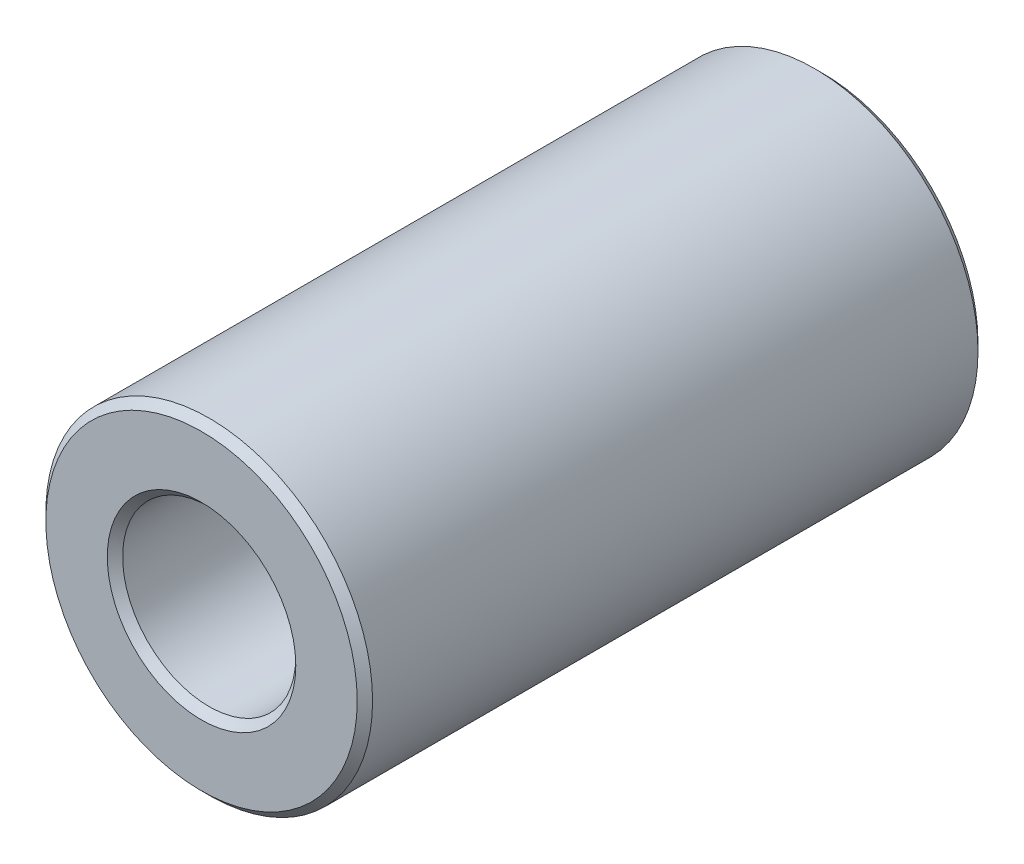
ISO-10303-21;
HEADER;
FILE_DESCRIPTION(('STEP AP214'),'2;1');
FILE_NAME('part.step','',(''),(''),'','','');
FILE_SCHEMA(('AUTOMOTIVE_DESIGN { 1 0 10303 214 1 1 1 1 }'));
ENDSEC;
DATA;
#1=APPLICATION_CONTEXT('core data for automotive mechanical design processes');
#2=APPLICATION_PROTOCOL_DEFINITION('international standard','automotive_design',2000,#1);
#3=PRODUCT_CONTEXT('',#1,'mechanical');
#4=PRODUCT('Part','Part','',(#3));
#5=PRODUCT_RELATED_PRODUCT_CATEGORY('part','',(#4));
#6=PRODUCT_DEFINITION_FORMATION('','',#4);
#7=PRODUCT_DEFINITION_CONTEXT('part definition',#1,'design');
#8=PRODUCT_DEFINITION('design','',#6,#7);
#9=PRODUCT_DEFINITION_SHAPE('','',#8);
#10=(LENGTH_UNIT() NAMED_UNIT(*) SI_UNIT(.MILLI.,.METRE.));
#11=(NAMED_UNIT(*) PLANE_ANGLE_UNIT() SI_UNIT($,.RADIAN.));
#12=(NAMED_UNIT(*) SI_UNIT($,.STERADIAN.) SOLID_ANGLE_UNIT());
#13=UNCERTAINTY_MEASURE_WITH_UNIT(LENGTH_MEASURE(1.E-05),#10,'distance_accuracy_value','');
#14=(GEOMETRIC_REPRESENTATION_CONTEXT(3) GLOBAL_UNCERTAINTY_ASSIGNED_CONTEXT((#13)) GLOBAL_UNIT_ASSIGNED_CONTEXT((#10,
#11,#12)) REPRESENTATION_CONTEXT('',''));
#15=CARTESIAN_POINT('',(0.,0.,0.));
#16=DIRECTION('',(0.,0.,1.));
#17=DIRECTION('',(1.,0.,0.));
#18=AXIS2_PLACEMENT_3D('',#15,#16,#17);
#19=CARTESIAN_POINT('',(0.,0.,-9.5));
#20=DIRECTION('',(0.,0.,1.));
#21=DIRECTION('',(1.,0.,0.));
#22=AXIS2_PLACEMENT_3D('',#19,#20,#21);
#23=CYLINDRICAL_SURFACE('',#22,5.);
#24=CARTESIAN_POINT('',(0.,0.,9.265));
#25=DIRECTION('',(0.,0.,1.));
#26=DIRECTION('',(1.,0.,0.));
#27=AXIS2_PLACEMENT_3D('',#24,#25,#26);
#28=CIRCLE('',#27,5.);
#29=CARTESIAN_POINT('',(5.,0.,9.265));
#30=VERTEX_POINT('',#29);
#31=EDGE_CURVE('E50',#30,#30,#28,.F.);
#32=ORIENTED_EDGE('',*,*,#31,.T.);
#33=EDGE_LOOP('',(#32));
#34=FACE_BOUND('',#33,.T.);
#35=CARTESIAN_POINT('',(0.,0.,-9.265));
#36=DIRECTION('',(0.,0.,1.));
#37=DIRECTION('',(1.,0.,0.));
#38=AXIS2_PLACEMENT_3D('',#35,#36,#37);
#39=CIRCLE('',#38,5.);
#40=CARTESIAN_POINT('',(5.,0.,-9.265));
#41=VERTEX_POINT('',#40);
#42=EDGE_CURVE('E53',#41,#41,#39,.T.);
#43=ORIENTED_EDGE('',*,*,#42,.T.);
#44=EDGE_LOOP('',(#43));
#45=FACE_BOUND('',#44,.T.);
#46=ADVANCED_FACE('F30',(#34,#45),#23,.T.);
#47=CARTESIAN_POINT('',(0.,0.,-9.5));
#48=DIRECTION('',(0.,0.,1.));
#49=DIRECTION('',(1.,0.,0.));
#50=AXIS2_PLACEMENT_3D('',#47,#48,#49);
#51=PLANE('',#50);
#52=CARTESIAN_POINT('',(0.,0.,-9.5));
#53=DIRECTION('',(0.,0.,1.));
#54=DIRECTION('',(1.,0.,0.));
#55=AXIS2_PLACEMENT_3D('',#52,#53,#54);
#56=CIRCLE('',#55,4.765);
#57=CARTESIAN_POINT('',(4.765,0.,-9.5));
#58=VERTEX_POINT('',#57);
#59=EDGE_CURVE('E41',#58,#58,#56,.F.);
#60=ORIENTED_EDGE('',*,*,#59,.T.);
#61=EDGE_LOOP('',(#60));
#62=FACE_BOUND('',#61,.T.);
#63=CARTESIAN_POINT('',(0.,0.,-9.5));
#64=DIRECTION('',(0.,0.,1.));
#65=DIRECTION('',(1.,0.,0.));
#66=AXIS2_PLACEMENT_3D('',#63,#64,#65);
#67=CIRCLE('',#66,2.885);
#68=CARTESIAN_POINT('',(2.885,0.,-9.5));
#69=VERTEX_POINT('',#68);
#70=EDGE_CURVE('E45',#69,#69,#67,.T.);
#71=ORIENTED_EDGE('',*,*,#70,.T.);
#72=EDGE_LOOP('',(#71));
#73=FACE_BOUND('',#72,.T.);
#74=ADVANCED_FACE('F78',(#62,#73),#51,.F.);
#75=CARTESIAN_POINT('',(0.,0.,-9.5));
#76=DIRECTION('',(0.,0.,1.));
#77=DIRECTION('',(1.,0.,0.));
#78=AXIS2_PLACEMENT_3D('',#75,#76,#77);
#79=CYLINDRICAL_SURFACE('',#78,2.65);
#80=CARTESIAN_POINT('',(0.,0.,9.265));
#81=DIRECTION('',(0.,0.,1.));
#82=DIRECTION('',(1.,0.,0.));
#83=AXIS2_PLACEMENT_3D('',#80,#81,#82);
#84=CIRCLE('',#83,2.65);
#85=CARTESIAN_POINT('',(2.65,0.,9.265));
#86=VERTEX_POINT('',#85);
#87=EDGE_CURVE('E10',#86,#86,#84,.T.);
#88=CARTESIAN_POINT('',(0.,0.,-9.265));
#89=DIRECTION('',(0.,0.,1.));
#90=DIRECTION('',(1.,0.,0.));
#91=AXIS2_PLACEMENT_3D('',#88,#89,#90);
#92=CIRCLE('',#91,2.65);
#93=CARTESIAN_POINT('',(2.65,0.,-9.265));
#94=VERTEX_POINT('',#93);
#95=EDGE_CURVE('E37',#94,#94,#92,.F.);
#96=CARTESIAN_POINT('',(2.65,0.,9.265));
#97=CARTESIAN_POINT('',(2.65,0.,9.07197916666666));
#98=CARTESIAN_POINT('',(2.65,0.,8.87895833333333));
#99=CARTESIAN_POINT('',(2.65,0.,8.49291666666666));
#100=CARTESIAN_POINT('',(2.65,0.,8.29989583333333));
#101=CARTESIAN_POINT('',(2.65,0.,7.91385416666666));
#102=CARTESIAN_POINT('',(2.65,0.,7.72083333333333));
#103=CARTESIAN_POINT('',(2.65,0.,7.33479166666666));
#104=CARTESIAN_POINT('',(2.65,0.,7.14177083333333));
#105=CARTESIAN_POINT('',(2.65,0.,6.75572916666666));
#106=CARTESIAN_POINT('',(2.65,0.,6.56270833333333));
#107=CARTESIAN_POINT('',(2.65,0.,6.17666666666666));
#108=CARTESIAN_POINT('',(2.65,0.,5.98364583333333));
#109=CARTESIAN_POINT('',(2.65,0.,5.59760416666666));
#110=CARTESIAN_POINT('',(2.65,0.,5.40458333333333));
#111=CARTESIAN_POINT('',(2.65,0.,5.01854166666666));
#112=CARTESIAN_POINT('',(2.65,0.,4.82552083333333));
#113=CARTESIAN_POINT('',(2.65,0.,4.43947916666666));
#114=CARTESIAN_POINT('',(2.65,0.,4.24645833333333));
#115=CARTESIAN_POINT('',(2.65,0.,3.86041666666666));
#116=CARTESIAN_POINT('',(2.65,0.,3.66739583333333));
#117=CARTESIAN_POINT('',(2.65,0.,3.28135416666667));
#118=CARTESIAN_POINT('',(2.65,0.,3.08833333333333));
#119=CARTESIAN_POINT('',(2.65,0.,2.70229166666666));
#120=CARTESIAN_POINT('',(2.65,0.,2.50927083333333));
#121=CARTESIAN_POINT('',(2.65,0.,2.12322916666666));
#122=CARTESIAN_POINT('',(2.65,0.,1.93020833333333));
#123=CARTESIAN_POINT('',(2.65,0.,1.54416666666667));
#124=CARTESIAN_POINT('',(2.65,0.,1.35114583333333));
#125=CARTESIAN_POINT('',(2.65,0.,0.965104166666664));
#126=CARTESIAN_POINT('',(2.65,0.,0.772083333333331));
#127=CARTESIAN_POINT('',(2.65,0.,0.386041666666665));
#128=CARTESIAN_POINT('',(2.65,0.,0.193020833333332));
#129=CARTESIAN_POINT('',(2.65,0.,-0.193020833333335));
#130=CARTESIAN_POINT('',(2.65,0.,-0.386041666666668));
#131=CARTESIAN_POINT('',(2.65,0.,-0.772083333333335));
#132=CARTESIAN_POINT('',(2.65,0.,-0.965104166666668));
#133=CARTESIAN_POINT('',(2.65,0.,-1.35114583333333));
#134=CARTESIAN_POINT('',(2.65,0.,-1.54416666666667));
#135=CARTESIAN_POINT('',(2.65,0.,-1.93020833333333));
#136=CARTESIAN_POINT('',(2.65,0.,-2.12322916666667));
#137=CARTESIAN_POINT('',(2.65,0.,-2.50927083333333));
#138=CARTESIAN_POINT('',(2.65,0.,-2.70229166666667));
#139=CARTESIAN_POINT('',(2.65,0.,-3.08833333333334));
#140=CARTESIAN_POINT('',(2.65,0.,-3.28135416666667));
#141=CARTESIAN_POINT('',(2.65,0.,-3.66739583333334));
#142=CARTESIAN_POINT('',(2.65,0.,-3.86041666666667));
#143=CARTESIAN_POINT('',(2.65,0.,-4.24645833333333));
#144=CARTESIAN_POINT('',(2.65,0.,-4.43947916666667));
#145=CARTESIAN_POINT('',(2.65,0.,-4.82552083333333));
#146=CARTESIAN_POINT('',(2.65,0.,-5.01854166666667));
#147=CARTESIAN_POINT('',(2.65,0.,-5.40458333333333));
#148=CARTESIAN_POINT('',(2.65,0.,-5.59760416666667));
#149=CARTESIAN_POINT('',(2.65,0.,-5.98364583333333));
#150=CARTESIAN_POINT('',(2.65,0.,-6.17666666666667));
#151=CARTESIAN_POINT('',(2.65,0.,-6.56270833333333));
#152=CARTESIAN_POINT('',(2.65,0.,-6.75572916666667));
#153=CARTESIAN_POINT('',(2.65,0.,-7.14177083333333));
#154=CARTESIAN_POINT('',(2.65,0.,-7.33479166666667));
#155=CARTESIAN_POINT('',(2.65,0.,-7.72083333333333));
#156=CARTESIAN_POINT('',(2.65,0.,-7.91385416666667));
#157=CARTESIAN_POINT('',(2.65,0.,-8.29989583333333));
#158=CARTESIAN_POINT('',(2.65,0.,-8.49291666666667));
#159=CARTESIAN_POINT('',(2.65,0.,-8.87895833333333));
#160=CARTESIAN_POINT('',(2.65,0.,-9.07197916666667));
#161=CARTESIAN_POINT('',(2.65,0.,-9.265));
#162=B_SPLINE_CURVE_WITH_KNOTS('',3,(#96,#97,#98,#99,#100,#101,#102,#103,#104,#105,#106,#107,
#108,#109,#110,#111,#112,#113,#114,#115,#116,#117,#118,#119,#120,#121,#122,#123,#124,#125,#126,
#127,#128,#129,#130,#131,#132,#133,#134,#135,#136,#137,#138,#139,#140,#141,#142,#143,#144,#145,
#146,#147,#148,#149,#150,#151,#152,#153,#154,#155,#156,#157,#158,#159,#160,#161),.UNSPECIFIED.,
.F.,.F.,(4,2,2,2,2,2,2,2,2,2,2,2,2,2,2,2,2,2,2,2,2,2,2,2,2,2,2,2,2,2,2,2,4),(0.,
0.579062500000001,1.158125,1.7371875,2.31625,2.8953125,3.474375,4.0534375,4.6325,5.2115625,
5.790625,6.3696875,6.94875,7.5278125,8.106875,8.6859375,9.265,9.8440625,10.423125,11.0021875,
11.58125,12.1603125,12.739375,13.3184375,13.8975,14.4765625,15.055625,15.6346875,16.21375,
16.7928125,17.371875,17.9509375,18.53),.UNSPECIFIED.);
#163=EDGE_CURVE('BSEAM84',#86,#94,#162,.T.);
#164=ORIENTED_EDGE('',*,*,#87,.T.);
#165=ORIENTED_EDGE('',*,*,#95,.T.);
#166=ORIENTED_EDGE('',*,*,#163,.T.);
#167=ORIENTED_EDGE('',*,*,#163,.F.);
#168=EDGE_LOOP('',(#164,#166,#165,#167));
#169=FACE_BOUND('',#168,.T.);
#170=ADVANCED_FACE('F84',(#169),#79,.F.);
#171=CARTESIAN_POINT('',(0.,0.,9.5));
#172=DIRECTION('',(0.,0.,1.));
#173=DIRECTION('',(1.,0.,0.));
#174=AXIS2_PLACEMENT_3D('',#171,#172,#173);
#175=PLANE('',#174);
#176=CARTESIAN_POINT('',(0.,0.,9.5));
#177=DIRECTION('',(0.,0.,1.));
#178=DIRECTION('',(1.,0.,0.));
#179=AXIS2_PLACEMENT_3D('',#176,#177,#178);
#180=CIRCLE('',#179,4.76500000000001);
#181=CARTESIAN_POINT('',(4.76500000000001,0.,9.5));
#182=VERTEX_POINT('',#181);
#183=EDGE_CURVE('E56',#182,#182,#180,.T.);
#184=ORIENTED_EDGE('',*,*,#183,.T.);
#185=EDGE_LOOP('',(#184));
#186=FACE_BOUND('',#185,.T.);
#187=CARTESIAN_POINT('',(0.,0.,9.5));
#188=DIRECTION('',(0.,0.,1.));
#189=DIRECTION('',(1.,0.,0.));
#190=AXIS2_PLACEMENT_3D('',#187,#188,#189);
#191=CIRCLE('',#190,2.88500000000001);
#192=CARTESIAN_POINT('',(2.885,0.,9.5));
#193=VERTEX_POINT('',#192);
#194=EDGE_CURVE('E59',#193,#193,#191,.F.);
#195=ORIENTED_EDGE('',*,*,#194,.T.);
#196=EDGE_LOOP('',(#195));
#197=FACE_BOUND('',#196,.T.);
#198=ADVANCED_FACE('F63',(#186,#197),#175,.T.);
#199=CARTESIAN_POINT('',(0.,0.,9.5));
#200=DIRECTION('',(0.,0.,-1.));
#201=DIRECTION('',(-1.,0.,0.));
#202=AXIS2_PLACEMENT_3D('',#199,#200,#201);
#203=CONICAL_SURFACE('',#202,4.76500000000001,0.785398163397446);
#204=ORIENTED_EDGE('',*,*,#31,.F.);
#205=EDGE_LOOP('',(#204));
#206=FACE_BOUND('',#205,.T.);
#207=ORIENTED_EDGE('',*,*,#183,.F.);
#208=EDGE_LOOP('',(#207));
#209=FACE_BOUND('',#208,.T.);
#210=ADVANCED_FACE('F74',(#206,#209),#203,.T.);
#211=CARTESIAN_POINT('',(0.,0.,-9.265));
#212=DIRECTION('',(0.,0.,1.));
#213=DIRECTION('',(1.,0.,0.));
#214=AXIS2_PLACEMENT_3D('',#211,#212,#213);
#215=CONICAL_SURFACE('',#214,5.,0.78539816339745);
#216=CARTESIAN_POINT('',(4.765,0.,-9.5));
#217=CARTESIAN_POINT('',(4.76744791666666,0.,-9.49755208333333));
#218=CARTESIAN_POINT('',(4.76989583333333,0.,-9.49510416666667));
#219=CARTESIAN_POINT('',(4.77479166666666,0.,-9.49020833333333));
#220=CARTESIAN_POINT('',(4.77723958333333,0.,-9.48776041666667));
#221=CARTESIAN_POINT('',(4.78213541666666,0.,-9.48286458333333));
#222=CARTESIAN_POINT('',(4.78458333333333,0.,-9.48041666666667));
#223=CARTESIAN_POINT('',(4.78947916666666,0.,-9.47552083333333));
#224=CARTESIAN_POINT('',(4.79192708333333,0.,-9.47307291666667));
#225=CARTESIAN_POINT('',(4.79682291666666,0.,-9.46817708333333));
#226=CARTESIAN_POINT('',(4.79927083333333,0.,-9.46572916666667));
#227=CARTESIAN_POINT('',(4.80416666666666,0.,-9.46083333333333));
#228=CARTESIAN_POINT('',(4.80661458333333,0.,-9.45838541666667));
#229=CARTESIAN_POINT('',(4.81151041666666,0.,-9.45348958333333));
#230=CARTESIAN_POINT('',(4.81395833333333,0.,-9.45104166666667));
#231=CARTESIAN_POINT('',(4.81885416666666,0.,-9.44614583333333));
#232=CARTESIAN_POINT('',(4.82130208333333,0.,-9.44369791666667));
#233=CARTESIAN_POINT('',(4.82619791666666,0.,-9.43880208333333));
#234=CARTESIAN_POINT('',(4.82864583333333,0.,-9.43635416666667));
#235=CARTESIAN_POINT('',(4.83354166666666,0.,-9.43145833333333));
#236=CARTESIAN_POINT('',(4.83598958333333,0.,-9.42901041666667));
#237=CARTESIAN_POINT('',(4.84088541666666,0.,-9.42411458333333));
#238=CARTESIAN_POINT('',(4.84333333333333,0.,-9.42166666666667));
#239=CARTESIAN_POINT('',(4.84822916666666,0.,-9.41677083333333));
#240=CARTESIAN_POINT('',(4.85067708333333,0.,-9.41432291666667));
#241=CARTESIAN_POINT('',(4.85557291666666,0.,-9.40942708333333));
#242=CARTESIAN_POINT('',(4.85802083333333,0.,-9.40697916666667));
#243=CARTESIAN_POINT('',(4.86291666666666,0.,-9.40208333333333));
#244=CARTESIAN_POINT('',(4.86536458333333,0.,-9.39963541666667));
#245=CARTESIAN_POINT('',(4.87026041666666,0.,-9.39473958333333));
#246=CARTESIAN_POINT('',(4.87270833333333,0.,-9.39229166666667));
#247=CARTESIAN_POINT('',(4.87760416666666,0.,-9.38739583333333));
#248=CARTESIAN_POINT('',(4.88005208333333,0.,-9.38494791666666));
#249=CARTESIAN_POINT('',(4.88494791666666,0.,-9.38005208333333));
#250=CARTESIAN_POINT('',(4.88739583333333,0.,-9.37760416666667));
#251=CARTESIAN_POINT('',(4.89229166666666,0.,-9.37270833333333));
#252=CARTESIAN_POINT('',(4.89473958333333,0.,-9.37026041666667));
#253=CARTESIAN_POINT('',(4.89963541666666,0.,-9.36536458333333));
#254=CARTESIAN_POINT('',(4.90208333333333,0.,-9.36291666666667));
#255=CARTESIAN_POINT('',(4.90697916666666,0.,-9.35802083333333));
#256=CARTESIAN_POINT('',(4.90942708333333,0.,-9.35557291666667));
#257=CARTESIAN_POINT('',(4.91432291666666,0.,-9.35067708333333));
#258=CARTESIAN_POINT('',(4.91677083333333,0.,-9.34822916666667));
#259=CARTESIAN_POINT('',(4.92166666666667,0.,-9.34333333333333));
#260=CARTESIAN_POINT('',(4.92411458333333,0.,-9.34088541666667));
#261=CARTESIAN_POINT('',(4.92901041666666,0.,-9.33598958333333));
#262=CARTESIAN_POINT('',(4.93145833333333,0.,-9.33354166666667));
#263=CARTESIAN_POINT('',(4.93635416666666,0.,-9.32864583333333));
#264=CARTESIAN_POINT('',(4.93880208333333,0.,-9.32619791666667));
#265=CARTESIAN_POINT('',(4.94369791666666,0.,-9.32130208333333));
#266=CARTESIAN_POINT('',(4.94614583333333,0.,-9.31885416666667));
#267=CARTESIAN_POINT('',(4.95104166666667,0.,-9.31395833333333));
#268=CARTESIAN_POINT('',(4.95348958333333,0.,-9.31151041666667));
#269=CARTESIAN_POINT('',(4.95838541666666,0.,-9.30661458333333));
#270=CARTESIAN_POINT('',(4.96083333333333,0.,-9.30416666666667));
#271=CARTESIAN_POINT('',(4.96572916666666,0.,-9.29927083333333));
#272=CARTESIAN_POINT('',(4.96817708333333,0.,-9.29682291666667));
#273=CARTESIAN_POINT('',(4.97307291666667,0.,-9.29192708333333));
#274=CARTESIAN_POINT('',(4.97552083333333,0.,-9.28947916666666));
#275=CARTESIAN_POINT('',(4.98041666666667,0.,-9.28458333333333));
#276=CARTESIAN_POINT('',(4.98286458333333,0.,-9.28213541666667));
#277=CARTESIAN_POINT('',(4.98776041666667,0.,-9.27723958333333));
#278=CARTESIAN_POINT('',(4.99020833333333,0.,-9.27479166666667));
#279=CARTESIAN_POINT('',(4.99510416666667,0.,-9.26989583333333));
#280=CARTESIAN_POINT('',(4.99755208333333,0.,-9.26744791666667));
#281=CARTESIAN_POINT('',(5.,0.,-9.265));
#282=B_SPLINE_CURVE_WITH_KNOTS('',3,(#216,#217,#218,#219,#220,#221,#222,#223,#224,#225,#226,
#227,#228,#229,#230,#231,#232,#233,#234,#235,#236,#237,#238,#239,#240,#241,#242,#243,#244,#245,
#246,#247,#248,#249,#250,#251,#252,#253,#254,#255,#256,#257,#258,#259,#260,#261,#262,#263,#264,
#265,#266,#267,#268,#269,#270,#271,#272,#273,#274,#275,#276,#277,#278,#279,#280,#281),
.UNSPECIFIED.,.F.,.F.,(4,2,2,2,2,2,2,2,2,2,2,2,2,2,2,2,2,2,2,2,2,2,2,2,2,2,2,2,2,2,2,2,4),(0.,
0.0103856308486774,0.0207712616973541,0.0311568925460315,0.0415425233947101,0.0519281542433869,
0.0623137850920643,0.0726994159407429,0.0830850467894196,0.093470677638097,0.103856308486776,
0.114241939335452,0.12462757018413,0.135013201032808,0.145398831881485,0.155784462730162,
0.166170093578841,0.176555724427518,0.186941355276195,0.197326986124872,0.207712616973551,
0.218098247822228,0.228483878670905,0.238869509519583,0.249255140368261,0.259640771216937,
0.270026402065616,0.280412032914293,0.29079766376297,0.301183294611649,0.311568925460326,
0.321954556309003,0.332340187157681),.UNSPECIFIED.);
#283=EDGE_CURVE('BSEAM68',#58,#41,#282,.T.);
#284=ORIENTED_EDGE('',*,*,#59,.F.);
#285=ORIENTED_EDGE('',*,*,#42,.F.);
#286=ORIENTED_EDGE('',*,*,#283,.T.);
#287=ORIENTED_EDGE('',*,*,#283,.F.);
#288=EDGE_LOOP('',(#284,#286,#285,#287));
#289=FACE_BOUND('',#288,.T.);
#290=ADVANCED_FACE('F68',(#289),#215,.T.);
#291=CARTESIAN_POINT('',(0.,0.,9.265));
#292=DIRECTION('',(0.,0.,1.));
#293=DIRECTION('',(1.,0.,0.));
#294=AXIS2_PLACEMENT_3D('',#291,#292,#293);
#295=CONICAL_SURFACE('',#294,2.65,0.785398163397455);
#296=CARTESIAN_POINT('',(2.885,0.,9.5));
#297=CARTESIAN_POINT('',(2.88255208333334,0.,9.49755208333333));
#298=CARTESIAN_POINT('',(2.88010416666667,0.,9.49510416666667));
#299=CARTESIAN_POINT('',(2.87520833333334,0.,9.49020833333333));
#300=CARTESIAN_POINT('',(2.87276041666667,0.,9.48776041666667));
#301=CARTESIAN_POINT('',(2.86786458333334,0.,9.48286458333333));
#302=CARTESIAN_POINT('',(2.86541666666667,0.,9.48041666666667));
#303=CARTESIAN_POINT('',(2.86052083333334,0.,9.47552083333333));
#304=CARTESIAN_POINT('',(2.85807291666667,0.,9.47307291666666));
#305=CARTESIAN_POINT('',(2.85317708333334,0.,9.46817708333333));
#306=CARTESIAN_POINT('',(2.85072916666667,0.,9.46572916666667));
#307=CARTESIAN_POINT('',(2.84583333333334,0.,9.46083333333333));
#308=CARTESIAN_POINT('',(2.84338541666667,0.,9.45838541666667));
#309=CARTESIAN_POINT('',(2.83848958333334,0.,9.45348958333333));
#310=CARTESIAN_POINT('',(2.83604166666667,0.,9.45104166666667));
#311=CARTESIAN_POINT('',(2.83114583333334,0.,9.44614583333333));
#312=CARTESIAN_POINT('',(2.82869791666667,0.,9.44369791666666));
#313=CARTESIAN_POINT('',(2.82380208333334,0.,9.43880208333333));
#314=CARTESIAN_POINT('',(2.82135416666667,0.,9.43635416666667));
#315=CARTESIAN_POINT('',(2.81645833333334,0.,9.43145833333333));
#316=CARTESIAN_POINT('',(2.81401041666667,0.,9.42901041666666));
#317=CARTESIAN_POINT('',(2.80911458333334,0.,9.42411458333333));
#318=CARTESIAN_POINT('',(2.80666666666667,0.,9.42166666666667));
#319=CARTESIAN_POINT('',(2.80177083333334,0.,9.41677083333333));
#320=CARTESIAN_POINT('',(2.79932291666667,0.,9.41432291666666));
#321=CARTESIAN_POINT('',(2.79442708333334,0.,9.40942708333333));
#322=CARTESIAN_POINT('',(2.79197916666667,0.,9.40697916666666));
#323=CARTESIAN_POINT('',(2.78708333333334,0.,9.40208333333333));
#324=CARTESIAN_POINT('',(2.78463541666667,0.,9.39963541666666));
#325=CARTESIAN_POINT('',(2.77973958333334,0.,9.39473958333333));
#326=CARTESIAN_POINT('',(2.77729166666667,0.,9.39229166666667));
#327=CARTESIAN_POINT('',(2.77239583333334,0.,9.38739583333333));
#328=CARTESIAN_POINT('',(2.76994791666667,0.,9.38494791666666));
#329=CARTESIAN_POINT('',(2.76505208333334,0.,9.38005208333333));
#330=CARTESIAN_POINT('',(2.76260416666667,0.,9.37760416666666));
#331=CARTESIAN_POINT('',(2.75770833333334,0.,9.37270833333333));
#332=CARTESIAN_POINT('',(2.75526041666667,0.,9.37026041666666));
#333=CARTESIAN_POINT('',(2.75036458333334,0.,9.36536458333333));
#334=CARTESIAN_POINT('',(2.74791666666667,0.,9.36291666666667));
#335=CARTESIAN_POINT('',(2.74302083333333,0.,9.35802083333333));
#336=CARTESIAN_POINT('',(2.74057291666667,0.,9.35557291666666));
#337=CARTESIAN_POINT('',(2.73567708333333,0.,9.35067708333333));
#338=CARTESIAN_POINT('',(2.73322916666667,0.,9.34822916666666));
#339=CARTESIAN_POINT('',(2.72833333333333,0.,9.34333333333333));
#340=CARTESIAN_POINT('',(2.72588541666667,0.,9.34088541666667));
#341=CARTESIAN_POINT('',(2.72098958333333,0.,9.33598958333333));
#342=CARTESIAN_POINT('',(2.71854166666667,0.,9.33354166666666));
#343=CARTESIAN_POINT('',(2.71364583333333,0.,9.32864583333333));
#344=CARTESIAN_POINT('',(2.71119791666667,0.,9.32619791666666));
#345=CARTESIAN_POINT('',(2.70630208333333,0.,9.32130208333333));
#346=CARTESIAN_POINT('',(2.70385416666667,0.,9.31885416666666));
#347=CARTESIAN_POINT('',(2.69895833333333,0.,9.31395833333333));
#348=CARTESIAN_POINT('',(2.69651041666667,0.,9.31151041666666));
#349=CARTESIAN_POINT('',(2.69161458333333,0.,9.30661458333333));
#350=CARTESIAN_POINT('',(2.68916666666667,0.,9.30416666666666));
#351=CARTESIAN_POINT('',(2.68427083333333,0.,9.29927083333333));
#352=CARTESIAN_POINT('',(2.68182291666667,0.,9.29682291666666));
#353=CARTESIAN_POINT('',(2.67692708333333,0.,9.29192708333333));
#354=CARTESIAN_POINT('',(2.67447916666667,0.,9.28947916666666));
#355=CARTESIAN_POINT('',(2.66958333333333,0.,9.28458333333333));
#356=CARTESIAN_POINT('',(2.66713541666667,0.,9.28213541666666));
#357=CARTESIAN_POINT('',(2.66223958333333,0.,9.27723958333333));
#358=CARTESIAN_POINT('',(2.65979166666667,0.,9.27479166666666));
#359=CARTESIAN_POINT('',(2.65489583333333,0.,9.26989583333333));
#360=CARTESIAN_POINT('',(2.65244791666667,0.,9.26744791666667));
#361=CARTESIAN_POINT('',(2.65,0.,9.265));
#362=B_SPLINE_CURVE_WITH_KNOTS('',3,(#296,#297,#298,#299,#300,#301,#302,#303,#304,#305,#306,
#307,#308,#309,#310,#311,#312,#313,#314,#315,#316,#317,#318,#319,#320,#321,#322,#323,#324,#325,
#326,#327,#328,#329,#330,#331,#332,#333,#334,#335,#336,#337,#338,#339,#340,#341,#342,#343,#344,
#345,#346,#347,#348,#349,#350,#351,#352,#353,#354,#355,#356,#357,#358,#359,#360,#361),
.UNSPECIFIED.,.F.,.F.,(4,2,2,2,2,2,2,2,2,2,2,2,2,2,2,2,2,2,2,2,2,2,2,2,2,2,2,2,2,2,2,2,4),(0.,
0.0103856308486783,0.0207712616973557,0.0311568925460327,0.0415425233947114,0.0519281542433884,
0.0623137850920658,0.0726994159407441,0.0830850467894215,0.0934706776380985,0.103856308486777,
0.114241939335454,0.124627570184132,0.13501320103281,0.145398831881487,0.155784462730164,
0.166170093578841,0.17655572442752,0.186941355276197,0.197326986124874,0.207712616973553,
0.21809824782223,0.228483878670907,0.238869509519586,0.249255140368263,0.25964077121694,
0.270026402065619,0.280412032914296,0.290797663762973,0.301183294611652,0.311568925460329,
0.321954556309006,0.332340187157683),.UNSPECIFIED.);
#363=EDGE_CURVE('BSEAM65',#193,#86,#362,.T.);
#364=ORIENTED_EDGE('',*,*,#194,.F.);
#365=ORIENTED_EDGE('',*,*,#87,.F.);
#366=ORIENTED_EDGE('',*,*,#363,.T.);
#367=ORIENTED_EDGE('',*,*,#363,.F.);
#368=EDGE_LOOP('',(#364,#366,#365,#367));
#369=FACE_BOUND('',#368,.T.);
#370=ADVANCED_FACE('F65',(#369),#295,.F.);
#371=CARTESIAN_POINT('',(0.,0.,-9.5));
#372=DIRECTION('',(0.,0.,-1.));
#373=DIRECTION('',(-1.,0.,0.));
#374=AXIS2_PLACEMENT_3D('',#371,#372,#373);
#375=CONICAL_SURFACE('',#374,2.885,0.785398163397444);
#376=ORIENTED_EDGE('',*,*,#95,.F.);
#377=EDGE_LOOP('',(#376));
#378=FACE_BOUND('',#377,.T.);
#379=ORIENTED_EDGE('',*,*,#70,.F.);
#380=EDGE_LOOP('',(#379));
#381=FACE_BOUND('',#380,.T.);
#382=ADVANCED_FACE('F32',(#378,#381),#375,.F.);
#383=CLOSED_SHELL('',(#46,#74,#170,#198,#210,#290,#370,#382));
#384=MANIFOLD_SOLID_BREP('B2',#383);
#385=ADVANCED_BREP_SHAPE_REPRESENTATION('',(#18,#384),#14);
#386=SHAPE_DEFINITION_REPRESENTATION(#9,#385);
ENDSEC;
END-ISO-10303-21;
